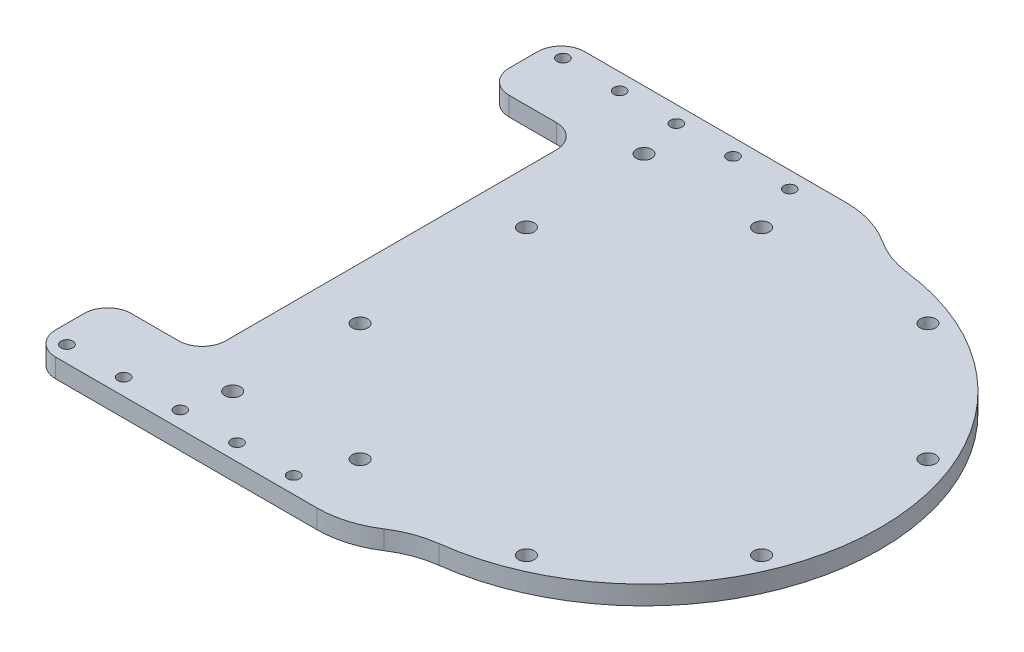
ISO-10303-21;
HEADER;
FILE_DESCRIPTION(('STEP AP214'),'2;1');
FILE_NAME('part.step','',(''),(''),'','','');
FILE_SCHEMA(('AUTOMOTIVE_DESIGN { 1 0 10303 214 1 1 1 1 }'));
ENDSEC;
DATA;
#1=APPLICATION_CONTEXT('core data for automotive mechanical design processes');
#2=APPLICATION_PROTOCOL_DEFINITION('international standard','automotive_design',2000,#1);
#3=PRODUCT_CONTEXT('',#1,'mechanical');
#4=PRODUCT('Part','Part','',(#3));
#5=PRODUCT_RELATED_PRODUCT_CATEGORY('part','',(#4));
#6=PRODUCT_DEFINITION_FORMATION('','',#4);
#7=PRODUCT_DEFINITION_CONTEXT('part definition',#1,'design');
#8=PRODUCT_DEFINITION('design','',#6,#7);
#9=PRODUCT_DEFINITION_SHAPE('','',#8);
#10=(LENGTH_UNIT() NAMED_UNIT(*) SI_UNIT(.MILLI.,.METRE.));
#11=(NAMED_UNIT(*) PLANE_ANGLE_UNIT() SI_UNIT($,.RADIAN.));
#12=(NAMED_UNIT(*) SI_UNIT($,.STERADIAN.) SOLID_ANGLE_UNIT());
#13=UNCERTAINTY_MEASURE_WITH_UNIT(LENGTH_MEASURE(1.E-05),#10,'distance_accuracy_value','');
#14=(GEOMETRIC_REPRESENTATION_CONTEXT(3) GLOBAL_UNCERTAINTY_ASSIGNED_CONTEXT((#13)) GLOBAL_UNIT_ASSIGNED_CONTEXT((#10,
#11,#12)) REPRESENTATION_CONTEXT('',''));
#15=CARTESIAN_POINT('',(0.,0.,0.));
#16=DIRECTION('',(0.,0.,1.));
#17=DIRECTION('',(1.,0.,0.));
#18=AXIS2_PLACEMENT_3D('',#15,#16,#17);
#19=CARTESIAN_POINT('',(83.4007857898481,3.,-81.060672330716));
#20=DIRECTION('',(1.,0.,0.));
#21=DIRECTION('',(0.,0.,-1.));
#22=AXIS2_PLACEMENT_3D('',#19,#20,#21);
#23=PLANE('',#22);
#24=DIRECTION('',(0.,1.,0.));
#25=VECTOR('',#24,1.);
#26=CARTESIAN_POINT('',(83.4007857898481,3.,45.));
#27=LINE('',#26,#25);
#28=CARTESIAN_POINT('',(83.4007857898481,-1.,45.));
#29=VERTEX_POINT('',#28);
#30=CARTESIAN_POINT('',(83.4007857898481,3.,45.));
#31=VERTEX_POINT('',#30);
#32=EDGE_CURVE('E11',#29,#31,#27,.T.);
#33=ORIENTED_EDGE('',*,*,#32,.F.);
#34=DIRECTION('',(0.,0.,1.));
#35=VECTOR('',#34,1.);
#36=CARTESIAN_POINT('',(83.4007857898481,-1.,0.));
#37=LINE('',#36,#35);
#38=CARTESIAN_POINT('',(83.4007857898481,-1.,51.));
#39=VERTEX_POINT('',#38);
#40=EDGE_CURVE('E152',#39,#29,#37,.F.);
#41=ORIENTED_EDGE('',*,*,#40,.F.);
#42=DIRECTION('',(0.,1.,0.));
#43=VECTOR('',#42,1.);
#44=CARTESIAN_POINT('',(83.4007857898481,3.,51.));
#45=LINE('',#44,#43);
#46=CARTESIAN_POINT('',(83.4007857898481,3.,51.));
#47=VERTEX_POINT('',#46);
#48=EDGE_CURVE('E64',#39,#47,#45,.T.);
#49=ORIENTED_EDGE('',*,*,#48,.T.);
#50=DIRECTION('',(0.,0.,-1.));
#51=VECTOR('',#50,1.);
#52=CARTESIAN_POINT('',(83.4007857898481,3.,-81.060672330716));
#53=LINE('',#52,#51);
#54=EDGE_CURVE('E291',#47,#31,#53,.T.);
#55=ORIENTED_EDGE('',*,*,#54,.T.);
#56=EDGE_LOOP('',(#33,#41,#49,#55));
#57=FACE_BOUND('',#56,.T.);
#58=ADVANCED_FACE('F53',(#57),#23,.F.);
#59=CARTESIAN_POINT('',(88.4007857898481,3.,51.));
#60=DIRECTION('',(0.,1.,0.));
#61=DIRECTION('',(0.,0.,1.));
#62=AXIS2_PLACEMENT_3D('',#59,#60,#61);
#63=CYLINDRICAL_SURFACE('',#62,5.);
#64=ORIENTED_EDGE('',*,*,#48,.F.);
#65=CARTESIAN_POINT('',(88.4007857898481,-1.,51.));
#66=DIRECTION('',(0.,1.,0.));
#67=DIRECTION('',(0.,0.,1.));
#68=AXIS2_PLACEMENT_3D('',#65,#66,#67);
#69=CIRCLE('',#68,5.);
#70=CARTESIAN_POINT('',(88.4007857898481,-1.,56.));
#71=VERTEX_POINT('',#70);
#72=EDGE_CURVE('E222',#39,#71,#69,.T.);
#73=ORIENTED_EDGE('',*,*,#72,.T.);
#74=DIRECTION('',(0.,1.,0.));
#75=VECTOR('',#74,1.);
#76=CARTESIAN_POINT('',(88.4007857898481,3.,56.));
#77=LINE('',#76,#75);
#78=CARTESIAN_POINT('',(88.4007857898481,3.,56.));
#79=VERTEX_POINT('',#78);
#80=EDGE_CURVE('E281',#71,#79,#77,.T.);
#81=ORIENTED_EDGE('',*,*,#80,.T.);
#82=CARTESIAN_POINT('',(88.4007857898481,3.,51.));
#83=DIRECTION('',(0.,1.,0.));
#84=DIRECTION('',(0.,0.,1.));
#85=AXIS2_PLACEMENT_3D('',#82,#83,#84);
#86=CIRCLE('',#85,5.);
#87=EDGE_CURVE('E300',#47,#79,#86,.T.);
#88=ORIENTED_EDGE('',*,*,#87,.F.);
#89=EDGE_LOOP('',(#64,#73,#81,#88));
#90=FACE_BOUND('',#89,.T.);
#91=ADVANCED_FACE('F305',(#90),#63,.T.);
#92=CARTESIAN_POINT('',(-100.,3.,56.));
#93=DIRECTION('',(0.,0.,1.));
#94=DIRECTION('',(1.,0.,0.));
#95=AXIS2_PLACEMENT_3D('',#92,#93,#94);
#96=PLANE('',#95);
#97=ORIENTED_EDGE('',*,*,#80,.F.);
#98=DIRECTION('',(1.,0.,0.));
#99=VECTOR('',#98,1.);
#100=CARTESIAN_POINT('',(0.,-1.,56.));
#101=LINE('',#100,#99);
#102=CARTESIAN_POINT('',(143.705644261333,-1.,56.));
#103=VERTEX_POINT('',#102);
#104=EDGE_CURVE('E218',#71,#103,#101,.T.);
#105=ORIENTED_EDGE('',*,*,#104,.T.);
#106=DIRECTION('',(0.,1.,0.));
#107=VECTOR('',#106,1.);
#108=CARTESIAN_POINT('',(143.705644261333,3.,56.));
#109=LINE('',#108,#107);
#110=CARTESIAN_POINT('',(143.705644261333,3.,56.));
#111=VERTEX_POINT('',#110);
#112=EDGE_CURVE('E277',#103,#111,#109,.T.);
#113=ORIENTED_EDGE('',*,*,#112,.T.);
#114=DIRECTION('',(1.,0.,0.));
#115=VECTOR('',#114,1.);
#116=CARTESIAN_POINT('',(-100.,3.,56.));
#117=LINE('',#116,#115);
#118=EDGE_CURVE('E307',#79,#111,#117,.T.);
#119=ORIENTED_EDGE('',*,*,#118,.F.);
#120=EDGE_LOOP('',(#97,#105,#113,#119));
#121=FACE_BOUND('',#120,.T.);
#122=ADVANCED_FACE('F459',(#121),#96,.T.);
#123=CARTESIAN_POINT('',(143.705644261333,3.,36.));
#124=DIRECTION('',(0.,1.,0.));
#125=DIRECTION('',(0.,0.,1.));
#126=AXIS2_PLACEMENT_3D('',#123,#124,#125);
#127=CYLINDRICAL_SURFACE('',#126,20.);
#128=ORIENTED_EDGE('',*,*,#112,.F.);
#129=CARTESIAN_POINT('',(143.705644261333,-1.,36.));
#130=DIRECTION('',(0.,1.,0.));
#131=DIRECTION('',(0.,0.,1.));
#132=AXIS2_PLACEMENT_3D('',#129,#130,#131);
#133=CIRCLE('',#132,20.);
#134=CARTESIAN_POINT('',(154.665979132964,-1.,52.7293472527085));
#135=VERTEX_POINT('',#134);
#136=EDGE_CURVE('E214',#103,#135,#133,.T.);
#137=ORIENTED_EDGE('',*,*,#136,.T.);
#138=DIRECTION('',(0.,1.,0.));
#139=VECTOR('',#138,1.);
#140=CARTESIAN_POINT('',(154.665979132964,3.,52.7293472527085));
#141=LINE('',#140,#139);
#142=CARTESIAN_POINT('',(154.665979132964,3.,52.7293472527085));
#143=VERTEX_POINT('',#142);
#144=EDGE_CURVE('E273',#135,#143,#141,.T.);
#145=ORIENTED_EDGE('',*,*,#144,.T.);
#146=CARTESIAN_POINT('',(143.705644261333,3.,36.));
#147=DIRECTION('',(0.,1.,0.));
#148=DIRECTION('',(0.,0.,1.));
#149=AXIS2_PLACEMENT_3D('',#146,#147,#148);
#150=CIRCLE('',#149,20.);
#151=EDGE_CURVE('E311',#111,#143,#150,.T.);
#152=ORIENTED_EDGE('',*,*,#151,.F.);
#153=EDGE_LOOP('',(#128,#137,#145,#152));
#154=FACE_BOUND('',#153,.T.);
#155=ADVANCED_FACE('F938',(#154),#127,.T.);
#156=CARTESIAN_POINT('',(165.626314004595,3.,69.458694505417));
#157=DIRECTION('',(0.,1.,0.));
#158=DIRECTION('',(0.,0.,1.));
#159=AXIS2_PLACEMENT_3D('',#156,#157,#158);
#160=CYLINDRICAL_SURFACE('',#159,20.);
#161=ORIENTED_EDGE('',*,*,#144,.F.);
#162=CARTESIAN_POINT('',(165.626314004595,-1.,69.458694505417));
#163=DIRECTION('',(0.,1.,0.));
#164=DIRECTION('',(0.,0.,1.));
#165=AXIS2_PLACEMENT_3D('',#162,#163,#164);
#166=CIRCLE('',#165,20.);
#167=CARTESIAN_POINT('',(163.14388994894,-1.,49.613353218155));
#168=VERTEX_POINT('',#167);
#169=EDGE_CURVE('E210',#135,#168,#166,.F.);
#170=ORIENTED_EDGE('',*,*,#169,.T.);
#171=DIRECTION('',(0.,1.,0.));
#172=VECTOR('',#171,1.);
#173=CARTESIAN_POINT('',(163.14388994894,3.,49.613353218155));
#174=LINE('',#173,#172);
#175=CARTESIAN_POINT('',(163.14388994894,3.,49.613353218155));
#176=VERTEX_POINT('',#175);
#177=EDGE_CURVE('E269',#168,#176,#174,.T.);
#178=ORIENTED_EDGE('',*,*,#177,.T.);
#179=CARTESIAN_POINT('',(165.626314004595,3.,69.458694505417));
#180=DIRECTION('',(0.,1.,0.));
#181=DIRECTION('',(0.,0.,1.));
#182=AXIS2_PLACEMENT_3D('',#179,#180,#181);
#183=CIRCLE('',#182,20.);
#184=EDGE_CURVE('E318',#143,#176,#183,.F.);
#185=ORIENTED_EDGE('',*,*,#184,.F.);
#186=EDGE_LOOP('',(#161,#170,#178,#185));
#187=FACE_BOUND('',#186,.T.);
#188=ADVANCED_FACE('F928',(#187),#160,.F.);
#189=CARTESIAN_POINT('',(156.937829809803,3.,0.));
#190=DIRECTION('',(0.,1.,0.));
#191=DIRECTION('',(0.,0.,1.));
#192=AXIS2_PLACEMENT_3D('',#189,#190,#191);
#193=CYLINDRICAL_SURFACE('',#192,50.);
#194=ORIENTED_EDGE('',*,*,#177,.F.);
#195=CARTESIAN_POINT('',(156.937829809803,-1.,0.));
#196=DIRECTION('',(0.,1.,0.));
#197=DIRECTION('',(0.,0.,1.));
#198=AXIS2_PLACEMENT_3D('',#195,#196,#197);
#199=CIRCLE('',#198,50.);
#200=CARTESIAN_POINT('',(163.14388994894,-1.,-49.613353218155));
#201=VERTEX_POINT('',#200);
#202=EDGE_CURVE('E206',#168,#201,#199,.T.);
#203=ORIENTED_EDGE('',*,*,#202,.T.);
#204=DIRECTION('',(0.,1.,0.));
#205=VECTOR('',#204,1.);
#206=CARTESIAN_POINT('',(163.14388994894,3.,-49.613353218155));
#207=LINE('',#206,#205);
#208=CARTESIAN_POINT('',(163.14388994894,3.,-49.613353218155));
#209=VERTEX_POINT('',#208);
#210=EDGE_CURVE('E265',#201,#209,#207,.T.);
#211=ORIENTED_EDGE('',*,*,#210,.T.);
#212=CARTESIAN_POINT('',(156.937829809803,3.,0.));
#213=DIRECTION('',(0.,1.,0.));
#214=DIRECTION('',(0.,0.,1.));
#215=AXIS2_PLACEMENT_3D('',#212,#213,#214);
#216=CIRCLE('',#215,50.);
#217=EDGE_CURVE('E322',#176,#209,#216,.T.);
#218=ORIENTED_EDGE('',*,*,#217,.F.);
#219=EDGE_LOOP('',(#194,#203,#211,#218));
#220=FACE_BOUND('',#219,.T.);
#221=ADVANCED_FACE('F919',(#220),#193,.T.);
#222=CARTESIAN_POINT('',(165.626314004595,3.,-69.458694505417));
#223=DIRECTION('',(0.,1.,0.));
#224=DIRECTION('',(0.,0.,1.));
#225=AXIS2_PLACEMENT_3D('',#222,#223,#224);
#226=CYLINDRICAL_SURFACE('',#225,20.);
#227=ORIENTED_EDGE('',*,*,#210,.F.);
#228=CARTESIAN_POINT('',(165.626314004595,-1.,-69.458694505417));
#229=DIRECTION('',(0.,1.,0.));
#230=DIRECTION('',(0.,0.,1.));
#231=AXIS2_PLACEMENT_3D('',#228,#229,#230);
#232=CIRCLE('',#231,20.);
#233=CARTESIAN_POINT('',(154.665979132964,-1.,-52.7293472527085));
#234=VERTEX_POINT('',#233);
#235=EDGE_CURVE('E202',#201,#234,#232,.F.);
#236=ORIENTED_EDGE('',*,*,#235,.T.);
#237=DIRECTION('',(0.,1.,0.));
#238=VECTOR('',#237,1.);
#239=CARTESIAN_POINT('',(154.665979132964,3.,-52.7293472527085));
#240=LINE('',#239,#238);
#241=CARTESIAN_POINT('',(154.665979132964,3.,-52.7293472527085));
#242=VERTEX_POINT('',#241);
#243=EDGE_CURVE('E261',#234,#242,#240,.T.);
#244=ORIENTED_EDGE('',*,*,#243,.T.);
#245=CARTESIAN_POINT('',(165.626314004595,3.,-69.458694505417));
#246=DIRECTION('',(0.,1.,0.));
#247=DIRECTION('',(0.,0.,1.));
#248=AXIS2_PLACEMENT_3D('',#245,#246,#247);
#249=CIRCLE('',#248,20.);
#250=EDGE_CURVE('E326',#209,#242,#249,.F.);
#251=ORIENTED_EDGE('',*,*,#250,.F.);
#252=EDGE_LOOP('',(#227,#236,#244,#251));
#253=FACE_BOUND('',#252,.T.);
#254=ADVANCED_FACE('F910',(#253),#226,.F.);
#255=CARTESIAN_POINT('',(143.705644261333,3.,-36.));
#256=DIRECTION('',(0.,1.,0.));
#257=DIRECTION('',(0.,0.,1.));
#258=AXIS2_PLACEMENT_3D('',#255,#256,#257);
#259=CYLINDRICAL_SURFACE('',#258,20.);
#260=ORIENTED_EDGE('',*,*,#243,.F.);
#261=CARTESIAN_POINT('',(143.705644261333,-1.,-36.));
#262=DIRECTION('',(0.,1.,0.));
#263=DIRECTION('',(0.,0.,1.));
#264=AXIS2_PLACEMENT_3D('',#261,#262,#263);
#265=CIRCLE('',#264,20.);
#266=CARTESIAN_POINT('',(143.705644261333,-1.,-56.));
#267=VERTEX_POINT('',#266);
#268=EDGE_CURVE('E198',#234,#267,#265,.T.);
#269=ORIENTED_EDGE('',*,*,#268,.T.);
#270=DIRECTION('',(0.,1.,0.));
#271=VECTOR('',#270,1.);
#272=CARTESIAN_POINT('',(143.705644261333,3.,-56.));
#273=LINE('',#272,#271);
#274=CARTESIAN_POINT('',(143.705644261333,3.,-56.));
#275=VERTEX_POINT('',#274);
#276=EDGE_CURVE('E257',#267,#275,#273,.T.);
#277=ORIENTED_EDGE('',*,*,#276,.T.);
#278=CARTESIAN_POINT('',(143.705644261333,3.,-36.));
#279=DIRECTION('',(0.,1.,0.));
#280=DIRECTION('',(0.,0.,1.));
#281=AXIS2_PLACEMENT_3D('',#278,#279,#280);
#282=CIRCLE('',#281,20.);
#283=EDGE_CURVE('E330',#242,#275,#282,.T.);
#284=ORIENTED_EDGE('',*,*,#283,.F.);
#285=EDGE_LOOP('',(#260,#269,#277,#284));
#286=FACE_BOUND('',#285,.T.);
#287=ADVANCED_FACE('F491',(#286),#259,.T.);
#288=CARTESIAN_POINT('',(-100.,3.,-56.));
#289=DIRECTION('',(0.,0.,-1.));
#290=DIRECTION('',(-1.,0.,0.));
#291=AXIS2_PLACEMENT_3D('',#288,#289,#290);
#292=PLANE('',#291);
#293=ORIENTED_EDGE('',*,*,#276,.F.);
#294=DIRECTION('',(1.,0.,0.));
#295=VECTOR('',#294,1.);
#296=CARTESIAN_POINT('',(0.,-1.,-56.));
#297=LINE('',#296,#295);
#298=CARTESIAN_POINT('',(88.4007857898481,-1.,-56.));
#299=VERTEX_POINT('',#298);
#300=EDGE_CURVE('E194',#267,#299,#297,.F.);
#301=ORIENTED_EDGE('',*,*,#300,.T.);
#302=DIRECTION('',(0.,1.,0.));
#303=VECTOR('',#302,1.);
#304=CARTESIAN_POINT('',(88.4007857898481,3.,-56.));
#305=LINE('',#304,#303);
#306=CARTESIAN_POINT('',(88.4007857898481,3.,-56.));
#307=VERTEX_POINT('',#306);
#308=EDGE_CURVE('E253',#299,#307,#305,.T.);
#309=ORIENTED_EDGE('',*,*,#308,.T.);
#310=DIRECTION('',(-1.,0.,0.));
#311=VECTOR('',#310,1.);
#312=CARTESIAN_POINT('',(-100.,3.,-56.));
#313=LINE('',#312,#311);
#314=EDGE_CURVE('E334',#275,#307,#313,.T.);
#315=ORIENTED_EDGE('',*,*,#314,.F.);
#316=EDGE_LOOP('',(#293,#301,#309,#315));
#317=FACE_BOUND('',#316,.T.);
#318=ADVANCED_FACE('F471',(#317),#292,.T.);
#319=CARTESIAN_POINT('',(88.4007857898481,3.,-51.));
#320=DIRECTION('',(0.,1.,0.));
#321=DIRECTION('',(0.,0.,1.));
#322=AXIS2_PLACEMENT_3D('',#319,#320,#321);
#323=CYLINDRICAL_SURFACE('',#322,5.);
#324=ORIENTED_EDGE('',*,*,#308,.F.);
#325=CARTESIAN_POINT('',(88.4007857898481,-1.,-51.));
#326=DIRECTION('',(0.,1.,0.));
#327=DIRECTION('',(0.,0.,1.));
#328=AXIS2_PLACEMENT_3D('',#325,#326,#327);
#329=CIRCLE('',#328,5.);
#330=CARTESIAN_POINT('',(83.4007857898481,-1.,-51.));
#331=VERTEX_POINT('',#330);
#332=EDGE_CURVE('E190',#299,#331,#329,.T.);
#333=ORIENTED_EDGE('',*,*,#332,.T.);
#334=DIRECTION('',(0.,1.,0.));
#335=VECTOR('',#334,1.);
#336=CARTESIAN_POINT('',(83.4007857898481,3.,-51.));
#337=LINE('',#336,#335);
#338=CARTESIAN_POINT('',(83.4007857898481,3.,-51.));
#339=VERTEX_POINT('',#338);
#340=EDGE_CURVE('E249',#331,#339,#337,.T.);
#341=ORIENTED_EDGE('',*,*,#340,.T.);
#342=CARTESIAN_POINT('',(88.4007857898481,3.,-51.));
#343=DIRECTION('',(0.,1.,0.));
#344=DIRECTION('',(0.,0.,1.));
#345=AXIS2_PLACEMENT_3D('',#342,#343,#344);
#346=CIRCLE('',#345,5.);
#347=EDGE_CURVE('E338',#307,#339,#346,.T.);
#348=ORIENTED_EDGE('',*,*,#347,.F.);
#349=EDGE_LOOP('',(#324,#333,#341,#348));
#350=FACE_BOUND('',#349,.T.);
#351=ADVANCED_FACE('F464',(#350),#323,.T.);
#352=ORIENTED_EDGE('',*,*,#340,.F.);
#353=DIRECTION('',(0.,0.,1.));
#354=VECTOR('',#353,1.);
#355=CARTESIAN_POINT('',(83.4007857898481,-1.,0.));
#356=LINE('',#355,#354);
#357=CARTESIAN_POINT('',(83.4007857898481,-1.,-45.));
#358=VERTEX_POINT('',#357);
#359=EDGE_CURVE('E186',#358,#331,#356,.F.);
#360=ORIENTED_EDGE('',*,*,#359,.F.);
#361=DIRECTION('',(0.,1.,0.));
#362=VECTOR('',#361,1.);
#363=CARTESIAN_POINT('',(83.4007857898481,3.,-45.));
#364=LINE('',#363,#362);
#365=CARTESIAN_POINT('',(83.4007857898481,3.,-45.));
#366=VERTEX_POINT('',#365);
#367=EDGE_CURVE('E245',#358,#366,#364,.T.);
#368=ORIENTED_EDGE('',*,*,#367,.T.);
#369=EDGE_CURVE('E304',#366,#339,#53,.T.);
#370=ORIENTED_EDGE('',*,*,#369,.T.);
#371=EDGE_LOOP('',(#352,#360,#368,#370));
#372=FACE_BOUND('',#371,.T.);
#373=ADVANCED_FACE('F456',(#372),#23,.F.);
#374=CARTESIAN_POINT('',(88.4007857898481,3.,-45.));
#375=DIRECTION('',(0.,1.,0.));
#376=DIRECTION('',(0.,0.,1.));
#377=AXIS2_PLACEMENT_3D('',#374,#375,#376);
#378=CYLINDRICAL_SURFACE('',#377,5.);
#379=ORIENTED_EDGE('',*,*,#367,.F.);
#380=CARTESIAN_POINT('',(88.4007857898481,-1.,-45.));
#381=DIRECTION('',(0.,1.,0.));
#382=DIRECTION('',(0.,0.,1.));
#383=AXIS2_PLACEMENT_3D('',#380,#381,#382);
#384=CIRCLE('',#383,5.);
#385=CARTESIAN_POINT('',(88.4007857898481,-1.,-40.));
#386=VERTEX_POINT('',#385);
#387=EDGE_CURVE('E182',#358,#386,#384,.T.);
#388=ORIENTED_EDGE('',*,*,#387,.T.);
#389=DIRECTION('',(0.,1.,0.));
#390=VECTOR('',#389,1.);
#391=CARTESIAN_POINT('',(88.4007857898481,3.,-40.));
#392=LINE('',#391,#390);
#393=CARTESIAN_POINT('',(88.4007857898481,3.,-40.));
#394=VERTEX_POINT('',#393);
#395=EDGE_CURVE('E241',#386,#394,#392,.T.);
#396=ORIENTED_EDGE('',*,*,#395,.T.);
#397=CARTESIAN_POINT('',(88.4007857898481,3.,-45.));
#398=DIRECTION('',(0.,1.,0.));
#399=DIRECTION('',(0.,0.,1.));
#400=AXIS2_PLACEMENT_3D('',#397,#398,#399);
#401=CIRCLE('',#400,5.);
#402=EDGE_CURVE('E342',#366,#394,#401,.T.);
#403=ORIENTED_EDGE('',*,*,#402,.F.);
#404=EDGE_LOOP('',(#379,#388,#396,#403));
#405=FACE_BOUND('',#404,.T.);
#406=ADVANCED_FACE('F463',(#405),#378,.T.);
#407=CARTESIAN_POINT('',(0.,3.,-40.));
#408=DIRECTION('',(0.,0.,-1.));
#409=DIRECTION('',(-1.,0.,0.));
#410=AXIS2_PLACEMENT_3D('',#407,#408,#409);
#411=PLANE('',#410);
#412=ORIENTED_EDGE('',*,*,#395,.F.);
#413=DIRECTION('',(1.,0.,0.));
#414=VECTOR('',#413,1.);
#415=CARTESIAN_POINT('',(0.,-1.,-40.));
#416=LINE('',#415,#414);
#417=CARTESIAN_POINT('',(98.4007857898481,-1.,-40.));
#418=VERTEX_POINT('',#417);
#419=EDGE_CURVE('E178',#418,#386,#416,.F.);
#420=ORIENTED_EDGE('',*,*,#419,.F.);
#421=DIRECTION('',(0.,1.,0.));
#422=VECTOR('',#421,1.);
#423=CARTESIAN_POINT('',(98.4007857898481,3.,-40.));
#424=LINE('',#423,#422);
#425=CARTESIAN_POINT('',(98.4007857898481,3.,-40.));
#426=VERTEX_POINT('',#425);
#427=EDGE_CURVE('E237',#418,#426,#424,.T.);
#428=ORIENTED_EDGE('',*,*,#427,.T.);
#429=DIRECTION('',(-1.,0.,0.));
#430=VECTOR('',#429,1.);
#431=CARTESIAN_POINT('',(0.,3.,-40.));
#432=LINE('',#431,#430);
#433=EDGE_CURVE('E346',#426,#394,#432,.T.);
#434=ORIENTED_EDGE('',*,*,#433,.T.);
#435=EDGE_LOOP('',(#412,#420,#428,#434));
#436=FACE_BOUND('',#435,.T.);
#437=ADVANCED_FACE('F469',(#436),#411,.F.);
#438=CARTESIAN_POINT('',(98.4007857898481,3.,-35.));
#439=DIRECTION('',(0.,1.,0.));
#440=DIRECTION('',(0.,0.,1.));
#441=AXIS2_PLACEMENT_3D('',#438,#439,#440);
#442=CYLINDRICAL_SURFACE('',#441,5.);
#443=ORIENTED_EDGE('',*,*,#427,.F.);
#444=CARTESIAN_POINT('',(98.4007857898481,-1.,-35.));
#445=DIRECTION('',(0.,1.,0.));
#446=DIRECTION('',(0.,0.,1.));
#447=AXIS2_PLACEMENT_3D('',#444,#445,#446);
#448=CIRCLE('',#447,5.);
#449=CARTESIAN_POINT('',(103.400785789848,-1.,-35.));
#450=VERTEX_POINT('',#449);
#451=EDGE_CURVE('E174',#418,#450,#448,.F.);
#452=ORIENTED_EDGE('',*,*,#451,.T.);
#453=DIRECTION('',(0.,1.,0.));
#454=VECTOR('',#453,1.);
#455=CARTESIAN_POINT('',(103.400785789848,3.,-35.));
#456=LINE('',#455,#454);
#457=CARTESIAN_POINT('',(103.400785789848,3.,-35.));
#458=VERTEX_POINT('',#457);
#459=EDGE_CURVE('E233',#450,#458,#456,.T.);
#460=ORIENTED_EDGE('',*,*,#459,.T.);
#461=CARTESIAN_POINT('',(98.4007857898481,3.,-35.));
#462=DIRECTION('',(0.,1.,0.));
#463=DIRECTION('',(0.,0.,1.));
#464=AXIS2_PLACEMENT_3D('',#461,#462,#463);
#465=CIRCLE('',#464,5.);
#466=EDGE_CURVE('E350',#426,#458,#465,.F.);
#467=ORIENTED_EDGE('',*,*,#466,.F.);
#468=EDGE_LOOP('',(#443,#452,#460,#467));
#469=FACE_BOUND('',#468,.T.);
#470=ADVANCED_FACE('F508',(#469),#442,.F.);
#471=CARTESIAN_POINT('',(103.400785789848,3.,0.));
#472=DIRECTION('',(1.,0.,0.));
#473=DIRECTION('',(0.,0.,-1.));
#474=AXIS2_PLACEMENT_3D('',#471,#472,#473);
#475=PLANE('',#474);
#476=ORIENTED_EDGE('',*,*,#459,.F.);
#477=DIRECTION('',(0.,0.,1.));
#478=VECTOR('',#477,1.);
#479=CARTESIAN_POINT('',(103.400785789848,-1.,0.));
#480=LINE('',#479,#478);
#481=CARTESIAN_POINT('',(103.400785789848,-1.,35.));
#482=VERTEX_POINT('',#481);
#483=EDGE_CURVE('E170',#482,#450,#480,.F.);
#484=ORIENTED_EDGE('',*,*,#483,.F.);
#485=DIRECTION('',(0.,1.,0.));
#486=VECTOR('',#485,1.);
#487=CARTESIAN_POINT('',(103.400785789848,3.,35.));
#488=LINE('',#487,#486);
#489=CARTESIAN_POINT('',(103.400785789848,3.,35.));
#490=VERTEX_POINT('',#489);
#491=EDGE_CURVE('E230',#482,#490,#488,.T.);
#492=ORIENTED_EDGE('',*,*,#491,.T.);
#493=DIRECTION('',(0.,0.,-1.));
#494=VECTOR('',#493,1.);
#495=CARTESIAN_POINT('',(103.400785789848,3.,0.));
#496=LINE('',#495,#494);
#497=EDGE_CURVE('E354',#490,#458,#496,.T.);
#498=ORIENTED_EDGE('',*,*,#497,.T.);
#499=EDGE_LOOP('',(#476,#484,#492,#498));
#500=FACE_BOUND('',#499,.T.);
#501=ADVANCED_FACE('F514',(#500),#475,.F.);
#502=CARTESIAN_POINT('',(98.4007857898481,3.,35.));
#503=DIRECTION('',(0.,1.,0.));
#504=DIRECTION('',(0.,0.,1.));
#505=AXIS2_PLACEMENT_3D('',#502,#503,#504);
#506=CYLINDRICAL_SURFACE('',#505,5.);
#507=ORIENTED_EDGE('',*,*,#491,.F.);
#508=CARTESIAN_POINT('',(98.4007857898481,-1.,35.));
#509=DIRECTION('',(0.,1.,0.));
#510=DIRECTION('',(0.,0.,1.));
#511=AXIS2_PLACEMENT_3D('',#508,#509,#510);
#512=CIRCLE('',#511,5.);
#513=CARTESIAN_POINT('',(98.4007857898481,-1.,40.));
#514=VERTEX_POINT('',#513);
#515=EDGE_CURVE('E166',#482,#514,#512,.F.);
#516=ORIENTED_EDGE('',*,*,#515,.T.);
#517=DIRECTION('',(0.,1.,0.));
#518=VECTOR('',#517,1.);
#519=CARTESIAN_POINT('',(98.4007857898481,3.,40.));
#520=LINE('',#519,#518);
#521=CARTESIAN_POINT('',(98.4007857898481,3.,40.));
#522=VERTEX_POINT('',#521);
#523=EDGE_CURVE('E72',#514,#522,#520,.T.);
#524=ORIENTED_EDGE('',*,*,#523,.T.);
#525=CARTESIAN_POINT('',(98.4007857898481,3.,35.));
#526=DIRECTION('',(0.,1.,0.));
#527=DIRECTION('',(0.,0.,1.));
#528=AXIS2_PLACEMENT_3D('',#525,#526,#527);
#529=CIRCLE('',#528,5.);
#530=EDGE_CURVE('E145',#490,#522,#529,.F.);
#531=ORIENTED_EDGE('',*,*,#530,.F.);
#532=EDGE_LOOP('',(#507,#516,#524,#531));
#533=FACE_BOUND('',#532,.T.);
#534=ADVANCED_FACE('F515',(#533),#506,.F.);
#535=CARTESIAN_POINT('',(0.,3.,40.));
#536=DIRECTION('',(0.,0.,-1.));
#537=DIRECTION('',(-1.,0.,0.));
#538=AXIS2_PLACEMENT_3D('',#535,#536,#537);
#539=PLANE('',#538);
#540=ORIENTED_EDGE('',*,*,#523,.F.);
#541=DIRECTION('',(1.,0.,0.));
#542=VECTOR('',#541,1.);
#543=CARTESIAN_POINT('',(0.,-1.,40.));
#544=LINE('',#543,#542);
#545=CARTESIAN_POINT('',(88.4007857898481,-1.,40.));
#546=VERTEX_POINT('',#545);
#547=EDGE_CURVE('E150',#514,#546,#544,.F.);
#548=ORIENTED_EDGE('',*,*,#547,.T.);
#549=DIRECTION('',(0.,1.,0.));
#550=VECTOR('',#549,1.);
#551=CARTESIAN_POINT('',(88.4007857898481,3.,40.));
#552=LINE('',#551,#550);
#553=CARTESIAN_POINT('',(88.4007857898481,3.,40.));
#554=VERTEX_POINT('',#553);
#555=EDGE_CURVE('E57',#546,#554,#552,.T.);
#556=ORIENTED_EDGE('',*,*,#555,.T.);
#557=DIRECTION('',(-1.,0.,0.));
#558=VECTOR('',#557,1.);
#559=CARTESIAN_POINT('',(0.,3.,40.));
#560=LINE('',#559,#558);
#561=EDGE_CURVE('E516',#522,#554,#560,.T.);
#562=ORIENTED_EDGE('',*,*,#561,.F.);
#563=EDGE_LOOP('',(#540,#548,#556,#562));
#564=FACE_BOUND('',#563,.T.);
#565=ADVANCED_FACE('F155',(#564),#539,.T.);
#566=CARTESIAN_POINT('',(99.2778298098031,3.,52.4999999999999));
#567=DIRECTION('',(0.,1.,0.));
#568=DIRECTION('',(0.,0.,1.));
#569=AXIS2_PLACEMENT_3D('',#566,#567,#568);
#570=CYLINDRICAL_SURFACE('',#569,1.25);
#571=CARTESIAN_POINT('',(99.2778298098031,3.,52.4999999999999));
#572=DIRECTION('',(0.,-1.,0.));
#573=DIRECTION('',(0.,0.,-1.));
#574=AXIS2_PLACEMENT_3D('',#571,#572,#573);
#575=CIRCLE('',#574,1.25);
#576=CARTESIAN_POINT('',(99.2778298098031,3.,51.2499999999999));
#577=VERTEX_POINT('',#576);
#578=EDGE_CURVE('E169',#577,#577,#575,.T.);
#579=ORIENTED_EDGE('',*,*,#578,.F.);
#580=EDGE_LOOP('',(#579));
#581=FACE_BOUND('',#580,.T.);
#582=CARTESIAN_POINT('',(99.2778298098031,-1.,52.4999999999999));
#583=DIRECTION('',(0.,-1.,0.));
#584=DIRECTION('',(0.,0.,-1.));
#585=AXIS2_PLACEMENT_3D('',#582,#583,#584);
#586=CIRCLE('',#585,1.25);
#587=CARTESIAN_POINT('',(99.2778298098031,-1.,51.2499999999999));
#588=VERTEX_POINT('',#587);
#589=EDGE_CURVE('E361',#588,#588,#586,.T.);
#590=ORIENTED_EDGE('',*,*,#589,.T.);
#591=EDGE_LOOP('',(#590));
#592=FACE_BOUND('',#591,.T.);
#593=ADVANCED_FACE('F605',(#581,#592),#570,.F.);
#594=CARTESIAN_POINT('',(135.277829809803,3.,52.5));
#595=DIRECTION('',(0.,1.,0.));
#596=DIRECTION('',(0.,0.,1.));
#597=AXIS2_PLACEMENT_3D('',#594,#595,#596);
#598=CYLINDRICAL_SURFACE('',#597,1.25000000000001);
#599=CARTESIAN_POINT('',(135.277829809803,3.,52.5));
#600=DIRECTION('',(0.,1.,0.));
#601=DIRECTION('',(0.,0.,1.));
#602=AXIS2_PLACEMENT_3D('',#599,#600,#601);
#603=CIRCLE('',#602,1.25000000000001);
#604=CARTESIAN_POINT('',(135.277829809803,3.,53.75));
#605=VERTEX_POINT('',#604);
#606=EDGE_CURVE('E594',#605,#605,#603,.F.);
#607=ORIENTED_EDGE('',*,*,#606,.F.);
#608=EDGE_LOOP('',(#607));
#609=FACE_BOUND('',#608,.T.);
#610=CARTESIAN_POINT('',(135.277829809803,-1.,52.5));
#611=DIRECTION('',(0.,1.,0.));
#612=DIRECTION('',(0.,0.,1.));
#613=AXIS2_PLACEMENT_3D('',#610,#611,#612);
#614=CIRCLE('',#613,1.25000000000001);
#615=CARTESIAN_POINT('',(135.277829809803,-1.,53.75));
#616=VERTEX_POINT('',#615);
#617=EDGE_CURVE('E365',#616,#616,#614,.F.);
#618=ORIENTED_EDGE('',*,*,#617,.T.);
#619=EDGE_LOOP('',(#618));
#620=FACE_BOUND('',#619,.T.);
#621=ADVANCED_FACE('F608',(#609,#620),#598,.F.);
#622=CARTESIAN_POINT('',(123.277829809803,3.,52.4999999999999));
#623=DIRECTION('',(0.,1.,0.));
#624=DIRECTION('',(0.,0.,1.));
#625=AXIS2_PLACEMENT_3D('',#622,#623,#624);
#626=CYLINDRICAL_SURFACE('',#625,1.25);
#627=CARTESIAN_POINT('',(123.277829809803,3.,52.4999999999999));
#628=DIRECTION('',(0.,1.,0.));
#629=DIRECTION('',(0.,0.,1.));
#630=AXIS2_PLACEMENT_3D('',#627,#628,#629);
#631=CIRCLE('',#630,1.25);
#632=CARTESIAN_POINT('',(123.277829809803,3.,53.7499999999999));
#633=VERTEX_POINT('',#632);
#634=EDGE_CURVE('E590',#633,#633,#631,.F.);
#635=ORIENTED_EDGE('',*,*,#634,.F.);
#636=EDGE_LOOP('',(#635));
#637=FACE_BOUND('',#636,.T.);
#638=CARTESIAN_POINT('',(123.277829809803,-1.,52.4999999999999));
#639=DIRECTION('',(0.,1.,0.));
#640=DIRECTION('',(0.,0.,1.));
#641=AXIS2_PLACEMENT_3D('',#638,#639,#640);
#642=CIRCLE('',#641,1.25);
#643=CARTESIAN_POINT('',(123.277829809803,-1.,53.7499999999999));
#644=VERTEX_POINT('',#643);
#645=EDGE_CURVE('E369',#644,#644,#642,.F.);
#646=ORIENTED_EDGE('',*,*,#645,.T.);
#647=EDGE_LOOP('',(#646));
#648=FACE_BOUND('',#647,.T.);
#649=ADVANCED_FACE('F706',(#637,#648),#626,.F.);
#650=CARTESIAN_POINT('',(87.2778298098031,3.,52.5));
#651=DIRECTION('',(0.,1.,0.));
#652=DIRECTION('',(0.,0.,1.));
#653=AXIS2_PLACEMENT_3D('',#650,#651,#652);
#654=CYLINDRICAL_SURFACE('',#653,1.25);
#655=CARTESIAN_POINT('',(87.2778298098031,3.,52.5));
#656=DIRECTION('',(0.,-1.,0.));
#657=DIRECTION('',(0.,0.,-1.));
#658=AXIS2_PLACEMENT_3D('',#655,#656,#657);
#659=CIRCLE('',#658,1.25);
#660=CARTESIAN_POINT('',(87.2778298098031,3.,51.25));
#661=VERTEX_POINT('',#660);
#662=EDGE_CURVE('E586',#661,#661,#659,.T.);
#663=ORIENTED_EDGE('',*,*,#662,.F.);
#664=EDGE_LOOP('',(#663));
#665=FACE_BOUND('',#664,.T.);
#666=CARTESIAN_POINT('',(87.2778298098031,-1.,52.5));
#667=DIRECTION('',(0.,-1.,0.));
#668=DIRECTION('',(0.,0.,-1.));
#669=AXIS2_PLACEMENT_3D('',#666,#667,#668);
#670=CIRCLE('',#669,1.25);
#671=CARTESIAN_POINT('',(87.2778298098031,-1.,51.25));
#672=VERTEX_POINT('',#671);
#673=EDGE_CURVE('E373',#672,#672,#670,.T.);
#674=ORIENTED_EDGE('',*,*,#673,.T.);
#675=EDGE_LOOP('',(#674));
#676=FACE_BOUND('',#675,.T.);
#677=ADVANCED_FACE('F702',(#665,#676),#654,.F.);
#678=CARTESIAN_POINT('',(111.277829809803,3.,52.4999999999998));
#679=DIRECTION('',(0.,1.,0.));
#680=DIRECTION('',(0.,0.,1.));
#681=AXIS2_PLACEMENT_3D('',#678,#679,#680);
#682=CYLINDRICAL_SURFACE('',#681,1.25);
#683=CARTESIAN_POINT('',(111.277829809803,3.,52.4999999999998));
#684=DIRECTION('',(0.,1.,0.));
#685=DIRECTION('',(0.,0.,1.));
#686=AXIS2_PLACEMENT_3D('',#683,#684,#685);
#687=CIRCLE('',#686,1.25);
#688=CARTESIAN_POINT('',(111.277829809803,3.,53.7499999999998));
#689=VERTEX_POINT('',#688);
#690=EDGE_CURVE('E582',#689,#689,#687,.F.);
#691=ORIENTED_EDGE('',*,*,#690,.F.);
#692=EDGE_LOOP('',(#691));
#693=FACE_BOUND('',#692,.T.);
#694=CARTESIAN_POINT('',(111.277829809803,-1.,52.4999999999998));
#695=DIRECTION('',(0.,1.,0.));
#696=DIRECTION('',(0.,0.,1.));
#697=AXIS2_PLACEMENT_3D('',#694,#695,#696);
#698=CIRCLE('',#697,1.25);
#699=CARTESIAN_POINT('',(111.277829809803,-1.,53.7499999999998));
#700=VERTEX_POINT('',#699);
#701=EDGE_CURVE('E377',#700,#700,#698,.F.);
#702=ORIENTED_EDGE('',*,*,#701,.T.);
#703=EDGE_LOOP('',(#702));
#704=FACE_BOUND('',#703,.T.);
#705=ADVANCED_FACE('F698',(#693,#704),#682,.F.);
#706=CARTESIAN_POINT('',(113.400785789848,3.,43.5370440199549));
#707=DIRECTION('',(0.,1.,0.));
#708=DIRECTION('',(0.,0.,1.));
#709=AXIS2_PLACEMENT_3D('',#706,#707,#708);
#710=CYLINDRICAL_SURFACE('',#709,1.65);
#711=CARTESIAN_POINT('',(113.400785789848,3.,43.5370440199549));
#712=DIRECTION('',(0.,1.,0.));
#713=DIRECTION('',(0.,0.,1.));
#714=AXIS2_PLACEMENT_3D('',#711,#712,#713);
#715=CIRCLE('',#714,1.65);
#716=CARTESIAN_POINT('',(113.400785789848,3.,45.1870440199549));
#717=VERTEX_POINT('',#716);
#718=EDGE_CURVE('E578',#717,#717,#715,.F.);
#719=ORIENTED_EDGE('',*,*,#718,.F.);
#720=EDGE_LOOP('',(#719));
#721=FACE_BOUND('',#720,.T.);
#722=CARTESIAN_POINT('',(113.400785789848,-1.,43.5370440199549));
#723=DIRECTION('',(0.,1.,0.));
#724=DIRECTION('',(0.,0.,1.));
#725=AXIS2_PLACEMENT_3D('',#722,#723,#724);
#726=CIRCLE('',#725,1.65);
#727=CARTESIAN_POINT('',(113.400785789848,-1.,45.1870440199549));
#728=VERTEX_POINT('',#727);
#729=EDGE_CURVE('E381',#728,#728,#726,.F.);
#730=ORIENTED_EDGE('',*,*,#729,.T.);
#731=EDGE_LOOP('',(#730));
#732=FACE_BOUND('',#731,.T.);
#733=ADVANCED_FACE('F694',(#721,#732),#710,.F.);
#734=CARTESIAN_POINT('',(139.335954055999,3.,42.4991055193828));
#735=DIRECTION('',(0.,1.,0.));
#736=DIRECTION('',(0.,0.,1.));
#737=AXIS2_PLACEMENT_3D('',#734,#735,#736);
#738=CYLINDRICAL_SURFACE('',#737,1.65000000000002);
#739=CARTESIAN_POINT('',(139.335954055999,3.,42.4991055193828));
#740=DIRECTION('',(0.,1.,0.));
#741=DIRECTION('',(0.,0.,1.));
#742=AXIS2_PLACEMENT_3D('',#739,#740,#741);
#743=CIRCLE('',#742,1.65000000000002);
#744=CARTESIAN_POINT('',(139.335954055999,3.,44.1491055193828));
#745=VERTEX_POINT('',#744);
#746=EDGE_CURVE('E574',#745,#745,#743,.T.);
#747=ORIENTED_EDGE('',*,*,#746,.T.);
#748=EDGE_LOOP('',(#747));
#749=FACE_BOUND('',#748,.T.);
#750=CARTESIAN_POINT('',(139.335954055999,-1.,42.4991055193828));
#751=DIRECTION('',(0.,1.,0.));
#752=DIRECTION('',(0.,0.,1.));
#753=AXIS2_PLACEMENT_3D('',#750,#751,#752);
#754=CIRCLE('',#753,1.65000000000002);
#755=CARTESIAN_POINT('',(139.335954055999,-1.,44.1491055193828));
#756=VERTEX_POINT('',#755);
#757=EDGE_CURVE('E385',#756,#756,#754,.T.);
#758=ORIENTED_EDGE('',*,*,#757,.F.);
#759=EDGE_LOOP('',(#758));
#760=FACE_BOUND('',#759,.T.);
#761=ADVANCED_FACE('F690',(#749,#760),#738,.F.);
#762=CARTESIAN_POINT('',(174.539705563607,3.,-42.4991055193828));
#763=DIRECTION('',(0.,1.,0.));
#764=DIRECTION('',(0.,0.,1.));
#765=AXIS2_PLACEMENT_3D('',#762,#763,#764);
#766=CYLINDRICAL_SURFACE('',#765,1.65000000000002);
#767=CARTESIAN_POINT('',(174.539705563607,3.,-42.4991055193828));
#768=DIRECTION('',(0.,1.,0.));
#769=DIRECTION('',(0.,0.,1.));
#770=AXIS2_PLACEMENT_3D('',#767,#768,#769);
#771=CIRCLE('',#770,1.65000000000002);
#772=CARTESIAN_POINT('',(174.539705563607,3.,-40.8491055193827));
#773=VERTEX_POINT('',#772);
#774=EDGE_CURVE('E570',#773,#773,#771,.T.);
#775=ORIENTED_EDGE('',*,*,#774,.T.);
#776=EDGE_LOOP('',(#775));
#777=FACE_BOUND('',#776,.T.);
#778=CARTESIAN_POINT('',(174.539705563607,-1.,-42.4991055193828));
#779=DIRECTION('',(0.,1.,0.));
#780=DIRECTION('',(0.,0.,1.));
#781=AXIS2_PLACEMENT_3D('',#778,#779,#780);
#782=CIRCLE('',#781,1.65000000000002);
#783=CARTESIAN_POINT('',(174.539705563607,-1.,-40.8491055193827));
#784=VERTEX_POINT('',#783);
#785=EDGE_CURVE('E389',#784,#784,#782,.T.);
#786=ORIENTED_EDGE('',*,*,#785,.F.);
#787=EDGE_LOOP('',(#786));
#788=FACE_BOUND('',#787,.T.);
#789=ADVANCED_FACE('F686',(#777,#788),#766,.F.);
#790=CARTESIAN_POINT('',(139.332829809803,3.,-42.4978114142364));
#791=DIRECTION('',(0.,1.,0.));
#792=DIRECTION('',(0.,0.,1.));
#793=AXIS2_PLACEMENT_3D('',#790,#791,#792);
#794=CYLINDRICAL_SURFACE('',#793,1.65000000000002);
#795=CARTESIAN_POINT('',(139.332829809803,3.,-42.4978114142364));
#796=DIRECTION('',(0.,1.,0.));
#797=DIRECTION('',(0.,0.,1.));
#798=AXIS2_PLACEMENT_3D('',#795,#796,#797);
#799=CIRCLE('',#798,1.65000000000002);
#800=CARTESIAN_POINT('',(139.332829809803,3.,-40.8478114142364));
#801=VERTEX_POINT('',#800);
#802=EDGE_CURVE('E566',#801,#801,#799,.T.);
#803=ORIENTED_EDGE('',*,*,#802,.T.);
#804=EDGE_LOOP('',(#803));
#805=FACE_BOUND('',#804,.T.);
#806=CARTESIAN_POINT('',(139.332829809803,-1.,-42.4978114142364));
#807=DIRECTION('',(0.,1.,0.));
#808=DIRECTION('',(0.,0.,1.));
#809=AXIS2_PLACEMENT_3D('',#806,#807,#808);
#810=CIRCLE('',#809,1.65000000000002);
#811=CARTESIAN_POINT('',(139.332829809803,-1.,-40.8478114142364));
#812=VERTEX_POINT('',#811);
#813=EDGE_CURVE('E393',#812,#812,#810,.T.);
#814=ORIENTED_EDGE('',*,*,#813,.F.);
#815=EDGE_LOOP('',(#814));
#816=FACE_BOUND('',#815,.T.);
#817=ADVANCED_FACE('F682',(#805,#816),#794,.F.);
#818=CARTESIAN_POINT('',(114.43872429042,3.,-17.6018757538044));
#819=DIRECTION('',(0.,1.,0.));
#820=DIRECTION('',(0.,0.,1.));
#821=AXIS2_PLACEMENT_3D('',#818,#819,#820);
#822=CYLINDRICAL_SURFACE('',#821,1.65);
#823=CARTESIAN_POINT('',(114.43872429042,3.,-17.6018757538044));
#824=DIRECTION('',(0.,1.,0.));
#825=DIRECTION('',(0.,0.,1.));
#826=AXIS2_PLACEMENT_3D('',#823,#824,#825);
#827=CIRCLE('',#826,1.65);
#828=CARTESIAN_POINT('',(114.43872429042,3.,-15.9518757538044));
#829=VERTEX_POINT('',#828);
#830=EDGE_CURVE('E562',#829,#829,#827,.T.);
#831=ORIENTED_EDGE('',*,*,#830,.T.);
#832=EDGE_LOOP('',(#831));
#833=FACE_BOUND('',#832,.T.);
#834=CARTESIAN_POINT('',(114.43872429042,-1.,-17.6018757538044));
#835=DIRECTION('',(0.,1.,0.));
#836=DIRECTION('',(0.,0.,1.));
#837=AXIS2_PLACEMENT_3D('',#834,#835,#836);
#838=CIRCLE('',#837,1.65);
#839=CARTESIAN_POINT('',(114.43872429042,-1.,-15.9518757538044));
#840=VERTEX_POINT('',#839);
#841=EDGE_CURVE('E397',#840,#840,#838,.T.);
#842=ORIENTED_EDGE('',*,*,#841,.F.);
#843=EDGE_LOOP('',(#842));
#844=FACE_BOUND('',#843,.T.);
#845=ADVANCED_FACE('F678',(#833,#844),#822,.F.);
#846=CARTESIAN_POINT('',(174.542829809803,3.,42.4978114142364));
#847=DIRECTION('',(0.,1.,0.));
#848=DIRECTION('',(0.,0.,1.));
#849=AXIS2_PLACEMENT_3D('',#846,#847,#848);
#850=CYLINDRICAL_SURFACE('',#849,1.65000000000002);
#851=CARTESIAN_POINT('',(174.542829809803,3.,42.4978114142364));
#852=DIRECTION('',(0.,1.,0.));
#853=DIRECTION('',(0.,0.,1.));
#854=AXIS2_PLACEMENT_3D('',#851,#852,#853);
#855=CIRCLE('',#854,1.65000000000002);
#856=CARTESIAN_POINT('',(174.542829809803,3.,44.1478114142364));
#857=VERTEX_POINT('',#856);
#858=EDGE_CURVE('E558',#857,#857,#855,.T.);
#859=ORIENTED_EDGE('',*,*,#858,.T.);
#860=EDGE_LOOP('',(#859));
#861=FACE_BOUND('',#860,.T.);
#862=CARTESIAN_POINT('',(174.542829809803,-1.,42.4978114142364));
#863=DIRECTION('',(0.,1.,0.));
#864=DIRECTION('',(0.,0.,1.));
#865=AXIS2_PLACEMENT_3D('',#862,#863,#864);
#866=CIRCLE('',#865,1.65000000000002);
#867=CARTESIAN_POINT('',(174.542829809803,-1.,44.1478114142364));
#868=VERTEX_POINT('',#867);
#869=EDGE_CURVE('E401',#868,#868,#866,.T.);
#870=ORIENTED_EDGE('',*,*,#869,.F.);
#871=EDGE_LOOP('',(#870));
#872=FACE_BOUND('',#871,.T.);
#873=ADVANCED_FACE('F674',(#861,#872),#850,.F.);
#874=CARTESIAN_POINT('',(199.436935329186,3.,17.6018757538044));
#875=DIRECTION('',(0.,1.,0.));
#876=DIRECTION('',(0.,0.,1.));
#877=AXIS2_PLACEMENT_3D('',#874,#875,#876);
#878=CYLINDRICAL_SURFACE('',#877,1.65000000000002);
#879=CARTESIAN_POINT('',(199.436935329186,3.,17.6018757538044));
#880=DIRECTION('',(0.,1.,0.));
#881=DIRECTION('',(0.,0.,1.));
#882=AXIS2_PLACEMENT_3D('',#879,#880,#881);
#883=CIRCLE('',#882,1.65000000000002);
#884=CARTESIAN_POINT('',(199.436935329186,3.,19.2518757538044));
#885=VERTEX_POINT('',#884);
#886=EDGE_CURVE('E554',#885,#885,#883,.T.);
#887=ORIENTED_EDGE('',*,*,#886,.T.);
#888=EDGE_LOOP('',(#887));
#889=FACE_BOUND('',#888,.T.);
#890=CARTESIAN_POINT('',(199.436935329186,-1.,17.6018757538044));
#891=DIRECTION('',(0.,1.,0.));
#892=DIRECTION('',(0.,0.,1.));
#893=AXIS2_PLACEMENT_3D('',#890,#891,#892);
#894=CIRCLE('',#893,1.65000000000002);
#895=CARTESIAN_POINT('',(199.436935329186,-1.,19.2518757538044));
#896=VERTEX_POINT('',#895);
#897=EDGE_CURVE('E405',#896,#896,#894,.T.);
#898=ORIENTED_EDGE('',*,*,#897,.F.);
#899=EDGE_LOOP('',(#898));
#900=FACE_BOUND('',#899,.T.);
#901=ADVANCED_FACE('F670',(#889,#900),#878,.F.);
#902=CARTESIAN_POINT('',(199.43564122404,3.,-17.605));
#903=DIRECTION('',(0.,1.,0.));
#904=DIRECTION('',(0.,0.,1.));
#905=AXIS2_PLACEMENT_3D('',#902,#903,#904);
#906=CYLINDRICAL_SURFACE('',#905,1.65000000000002);
#907=CARTESIAN_POINT('',(199.43564122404,3.,-17.605));
#908=DIRECTION('',(0.,1.,0.));
#909=DIRECTION('',(0.,0.,1.));
#910=AXIS2_PLACEMENT_3D('',#907,#908,#909);
#911=CIRCLE('',#910,1.65000000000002);
#912=CARTESIAN_POINT('',(199.43564122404,3.,-15.955));
#913=VERTEX_POINT('',#912);
#914=EDGE_CURVE('E550',#913,#913,#911,.T.);
#915=ORIENTED_EDGE('',*,*,#914,.T.);
#916=EDGE_LOOP('',(#915));
#917=FACE_BOUND('',#916,.T.);
#918=CARTESIAN_POINT('',(199.43564122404,-1.,-17.605));
#919=DIRECTION('',(0.,1.,0.));
#920=DIRECTION('',(0.,0.,1.));
#921=AXIS2_PLACEMENT_3D('',#918,#919,#920);
#922=CIRCLE('',#921,1.65000000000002);
#923=CARTESIAN_POINT('',(199.43564122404,-1.,-15.955));
#924=VERTEX_POINT('',#923);
#925=EDGE_CURVE('E409',#924,#924,#922,.T.);
#926=ORIENTED_EDGE('',*,*,#925,.F.);
#927=EDGE_LOOP('',(#926));
#928=FACE_BOUND('',#927,.T.);
#929=ADVANCED_FACE('F666',(#917,#928),#906,.F.);
#930=CARTESIAN_POINT('',(114.440018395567,3.,17.605));
#931=DIRECTION('',(0.,1.,0.));
#932=DIRECTION('',(0.,0.,1.));
#933=AXIS2_PLACEMENT_3D('',#930,#931,#932);
#934=CYLINDRICAL_SURFACE('',#933,1.65);
#935=CARTESIAN_POINT('',(114.440018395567,3.,17.605));
#936=DIRECTION('',(0.,1.,0.));
#937=DIRECTION('',(0.,0.,1.));
#938=AXIS2_PLACEMENT_3D('',#935,#936,#937);
#939=CIRCLE('',#938,1.65);
#940=CARTESIAN_POINT('',(114.440018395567,3.,19.255));
#941=VERTEX_POINT('',#940);
#942=EDGE_CURVE('E546',#941,#941,#939,.T.);
#943=ORIENTED_EDGE('',*,*,#942,.T.);
#944=EDGE_LOOP('',(#943));
#945=FACE_BOUND('',#944,.T.);
#946=CARTESIAN_POINT('',(114.440018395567,-1.,17.605));
#947=DIRECTION('',(0.,1.,0.));
#948=DIRECTION('',(0.,0.,1.));
#949=AXIS2_PLACEMENT_3D('',#946,#947,#948);
#950=CIRCLE('',#949,1.65);
#951=CARTESIAN_POINT('',(114.440018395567,-1.,19.255));
#952=VERTEX_POINT('',#951);
#953=EDGE_CURVE('E413',#952,#952,#950,.T.);
#954=ORIENTED_EDGE('',*,*,#953,.F.);
#955=EDGE_LOOP('',(#954));
#956=FACE_BOUND('',#955,.T.);
#957=ADVANCED_FACE('F662',(#945,#956),#934,.F.);
#958=CARTESIAN_POINT('',(113.400785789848,3.,-43.5370440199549));
#959=DIRECTION('',(0.,1.,0.));
#960=DIRECTION('',(0.,0.,1.));
#961=AXIS2_PLACEMENT_3D('',#958,#959,#960);
#962=CYLINDRICAL_SURFACE('',#961,1.65);
#963=CARTESIAN_POINT('',(113.400785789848,3.,-43.5370440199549));
#964=DIRECTION('',(0.,1.,0.));
#965=DIRECTION('',(0.,0.,1.));
#966=AXIS2_PLACEMENT_3D('',#963,#964,#965);
#967=CIRCLE('',#966,1.65);
#968=CARTESIAN_POINT('',(113.400785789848,3.,-41.8870440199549));
#969=VERTEX_POINT('',#968);
#970=EDGE_CURVE('E542',#969,#969,#967,.T.);
#971=ORIENTED_EDGE('',*,*,#970,.T.);
#972=EDGE_LOOP('',(#971));
#973=FACE_BOUND('',#972,.T.);
#974=CARTESIAN_POINT('',(113.400785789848,-1.,-43.5370440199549));
#975=DIRECTION('',(0.,1.,0.));
#976=DIRECTION('',(0.,0.,1.));
#977=AXIS2_PLACEMENT_3D('',#974,#975,#976);
#978=CIRCLE('',#977,1.65);
#979=CARTESIAN_POINT('',(113.400785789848,-1.,-41.8870440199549));
#980=VERTEX_POINT('',#979);
#981=EDGE_CURVE('E417',#980,#980,#978,.T.);
#982=ORIENTED_EDGE('',*,*,#981,.F.);
#983=EDGE_LOOP('',(#982));
#984=FACE_BOUND('',#983,.T.);
#985=ADVANCED_FACE('F656',(#973,#984),#962,.F.);
#986=CARTESIAN_POINT('',(111.277829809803,3.,-52.4999999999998));
#987=DIRECTION('',(0.,1.,0.));
#988=DIRECTION('',(0.,0.,1.));
#989=AXIS2_PLACEMENT_3D('',#986,#987,#988);
#990=CYLINDRICAL_SURFACE('',#989,1.25);
#991=CARTESIAN_POINT('',(111.277829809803,3.,-52.4999999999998));
#992=DIRECTION('',(0.,1.,0.));
#993=DIRECTION('',(0.,0.,1.));
#994=AXIS2_PLACEMENT_3D('',#991,#992,#993);
#995=CIRCLE('',#994,1.25);
#996=CARTESIAN_POINT('',(111.277829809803,3.,-51.2499999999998));
#997=VERTEX_POINT('',#996);
#998=EDGE_CURVE('E538',#997,#997,#995,.T.);
#999=ORIENTED_EDGE('',*,*,#998,.T.);
#1000=EDGE_LOOP('',(#999));
#1001=FACE_BOUND('',#1000,.T.);
#1002=CARTESIAN_POINT('',(111.277829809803,-1.,-52.4999999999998));
#1003=DIRECTION('',(0.,1.,0.));
#1004=DIRECTION('',(0.,0.,1.));
#1005=AXIS2_PLACEMENT_3D('',#1002,#1003,#1004);
#1006=CIRCLE('',#1005,1.25);
#1007=CARTESIAN_POINT('',(111.277829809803,-1.,-51.2499999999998));
#1008=VERTEX_POINT('',#1007);
#1009=EDGE_CURVE('E421',#1008,#1008,#1006,.T.);
#1010=ORIENTED_EDGE('',*,*,#1009,.F.);
#1011=EDGE_LOOP('',(#1010));
#1012=FACE_BOUND('',#1011,.T.);
#1013=ADVANCED_FACE('F651',(#1001,#1012),#990,.F.);
#1014=CARTESIAN_POINT('',(123.277829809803,3.,-52.4999999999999));
#1015=DIRECTION('',(0.,1.,0.));
#1016=DIRECTION('',(0.,0.,1.));
#1017=AXIS2_PLACEMENT_3D('',#1014,#1015,#1016);
#1018=CYLINDRICAL_SURFACE('',#1017,1.25);
#1019=CARTESIAN_POINT('',(123.277829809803,3.,-52.4999999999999));
#1020=DIRECTION('',(0.,1.,0.));
#1021=DIRECTION('',(0.,0.,1.));
#1022=AXIS2_PLACEMENT_3D('',#1019,#1020,#1021);
#1023=CIRCLE('',#1022,1.25);
#1024=CARTESIAN_POINT('',(123.277829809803,3.,-51.2499999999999));
#1025=VERTEX_POINT('',#1024);
#1026=EDGE_CURVE('E534',#1025,#1025,#1023,.T.);
#1027=ORIENTED_EDGE('',*,*,#1026,.T.);
#1028=EDGE_LOOP('',(#1027));
#1029=FACE_BOUND('',#1028,.T.);
#1030=CARTESIAN_POINT('',(123.277829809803,-1.,-52.4999999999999));
#1031=DIRECTION('',(0.,1.,0.));
#1032=DIRECTION('',(0.,0.,1.));
#1033=AXIS2_PLACEMENT_3D('',#1030,#1031,#1032);
#1034=CIRCLE('',#1033,1.25);
#1035=CARTESIAN_POINT('',(123.277829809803,-1.,-51.2499999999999));
#1036=VERTEX_POINT('',#1035);
#1037=EDGE_CURVE('E425',#1036,#1036,#1034,.T.);
#1038=ORIENTED_EDGE('',*,*,#1037,.F.);
#1039=EDGE_LOOP('',(#1038));
#1040=FACE_BOUND('',#1039,.T.);
#1041=ADVANCED_FACE('F450',(#1029,#1040),#1018,.F.);
#1042=CARTESIAN_POINT('',(87.2778298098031,3.,-52.4999999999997));
#1043=DIRECTION('',(0.,1.,0.));
#1044=DIRECTION('',(0.,0.,1.));
#1045=AXIS2_PLACEMENT_3D('',#1042,#1043,#1044);
#1046=CYLINDRICAL_SURFACE('',#1045,1.25);
#1047=CARTESIAN_POINT('',(87.2778298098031,3.,-52.4999999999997));
#1048=DIRECTION('',(0.,1.,0.));
#1049=DIRECTION('',(0.,0.,1.));
#1050=AXIS2_PLACEMENT_3D('',#1047,#1048,#1049);
#1051=CIRCLE('',#1050,1.25);
#1052=CARTESIAN_POINT('',(87.2778298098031,3.,-51.2499999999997));
#1053=VERTEX_POINT('',#1052);
#1054=EDGE_CURVE('E530',#1053,#1053,#1051,.T.);
#1055=ORIENTED_EDGE('',*,*,#1054,.T.);
#1056=EDGE_LOOP('',(#1055));
#1057=FACE_BOUND('',#1056,.T.);
#1058=CARTESIAN_POINT('',(87.2778298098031,-1.,-52.4999999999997));
#1059=DIRECTION('',(0.,1.,0.));
#1060=DIRECTION('',(0.,0.,1.));
#1061=AXIS2_PLACEMENT_3D('',#1058,#1059,#1060);
#1062=CIRCLE('',#1061,1.25);
#1063=CARTESIAN_POINT('',(87.2778298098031,-1.,-51.2499999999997));
#1064=VERTEX_POINT('',#1063);
#1065=EDGE_CURVE('E429',#1064,#1064,#1062,.T.);
#1066=ORIENTED_EDGE('',*,*,#1065,.F.);
#1067=EDGE_LOOP('',(#1066));
#1068=FACE_BOUND('',#1067,.T.);
#1069=ADVANCED_FACE('F442',(#1057,#1068),#1046,.F.);
#1070=CARTESIAN_POINT('',(99.2778298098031,3.,-52.4999999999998));
#1071=DIRECTION('',(0.,1.,0.));
#1072=DIRECTION('',(0.,0.,1.));
#1073=AXIS2_PLACEMENT_3D('',#1070,#1071,#1072);
#1074=CYLINDRICAL_SURFACE('',#1073,1.25);
#1075=CARTESIAN_POINT('',(99.2778298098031,3.,-52.4999999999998));
#1076=DIRECTION('',(0.,1.,0.));
#1077=DIRECTION('',(0.,0.,1.));
#1078=AXIS2_PLACEMENT_3D('',#1075,#1076,#1077);
#1079=CIRCLE('',#1078,1.25);
#1080=CARTESIAN_POINT('',(99.2778298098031,3.,-51.2499999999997));
#1081=VERTEX_POINT('',#1080);
#1082=EDGE_CURVE('E525',#1081,#1081,#1079,.T.);
#1083=ORIENTED_EDGE('',*,*,#1082,.T.);
#1084=EDGE_LOOP('',(#1083));
#1085=FACE_BOUND('',#1084,.T.);
#1086=CARTESIAN_POINT('',(99.2778298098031,-1.,-52.4999999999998));
#1087=DIRECTION('',(0.,1.,0.));
#1088=DIRECTION('',(0.,0.,1.));
#1089=AXIS2_PLACEMENT_3D('',#1086,#1087,#1088);
#1090=CIRCLE('',#1089,1.25);
#1091=CARTESIAN_POINT('',(99.2778298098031,-1.,-51.2499999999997));
#1092=VERTEX_POINT('',#1091);
#1093=EDGE_CURVE('E162',#1092,#1092,#1090,.T.);
#1094=ORIENTED_EDGE('',*,*,#1093,.F.);
#1095=EDGE_LOOP('',(#1094));
#1096=FACE_BOUND('',#1095,.T.);
#1097=ADVANCED_FACE('F439',(#1085,#1096),#1074,.F.);
#1098=CARTESIAN_POINT('',(135.277829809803,3.,-52.5));
#1099=DIRECTION('',(0.,1.,0.));
#1100=DIRECTION('',(0.,0.,1.));
#1101=AXIS2_PLACEMENT_3D('',#1098,#1099,#1100);
#1102=CYLINDRICAL_SURFACE('',#1101,1.25000000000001);
#1103=CARTESIAN_POINT('',(135.277829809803,3.,-52.5));
#1104=DIRECTION('',(0.,1.,0.));
#1105=DIRECTION('',(0.,0.,1.));
#1106=AXIS2_PLACEMENT_3D('',#1103,#1104,#1105);
#1107=CIRCLE('',#1106,1.25000000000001);
#1108=CARTESIAN_POINT('',(135.277829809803,3.,-51.25));
#1109=VERTEX_POINT('',#1108);
#1110=EDGE_CURVE('E519',#1109,#1109,#1107,.T.);
#1111=ORIENTED_EDGE('',*,*,#1110,.T.);
#1112=EDGE_LOOP('',(#1111));
#1113=FACE_BOUND('',#1112,.T.);
#1114=CARTESIAN_POINT('',(135.277829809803,-1.,-52.5));
#1115=DIRECTION('',(0.,1.,0.));
#1116=DIRECTION('',(0.,0.,1.));
#1117=AXIS2_PLACEMENT_3D('',#1114,#1115,#1116);
#1118=CIRCLE('',#1117,1.25000000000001);
#1119=CARTESIAN_POINT('',(135.277829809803,-1.,-51.25));
#1120=VERTEX_POINT('',#1119);
#1121=EDGE_CURVE('E157',#1120,#1120,#1118,.T.);
#1122=ORIENTED_EDGE('',*,*,#1121,.F.);
#1123=EDGE_LOOP('',(#1122));
#1124=FACE_BOUND('',#1123,.T.);
#1125=ADVANCED_FACE('F441',(#1113,#1124),#1102,.F.);
#1126=CARTESIAN_POINT('',(88.4007857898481,3.,45.));
#1127=DIRECTION('',(0.,1.,0.));
#1128=DIRECTION('',(0.,0.,1.));
#1129=AXIS2_PLACEMENT_3D('',#1126,#1127,#1128);
#1130=CYLINDRICAL_SURFACE('',#1129,5.);
#1131=CARTESIAN_POINT('',(88.4007857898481,-1.,45.));
#1132=DIRECTION('',(0.,1.,0.));
#1133=DIRECTION('',(0.,0.,1.));
#1134=AXIS2_PLACEMENT_3D('',#1131,#1132,#1133);
#1135=CIRCLE('',#1134,5.);
#1136=EDGE_CURVE('E138',#546,#29,#1135,.T.);
#1137=ORIENTED_EDGE('',*,*,#1136,.T.);
#1138=ORIENTED_EDGE('',*,*,#32,.T.);
#1139=CARTESIAN_POINT('',(88.4007857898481,3.,45.));
#1140=DIRECTION('',(0.,1.,0.));
#1141=DIRECTION('',(0.,0.,1.));
#1142=AXIS2_PLACEMENT_3D('',#1139,#1140,#1141);
#1143=CIRCLE('',#1142,5.);
#1144=EDGE_CURVE('E140',#554,#31,#1143,.T.);
#1145=ORIENTED_EDGE('',*,*,#1144,.F.);
#1146=ORIENTED_EDGE('',*,*,#555,.F.);
#1147=EDGE_LOOP('',(#1137,#1138,#1145,#1146));
#1148=FACE_BOUND('',#1147,.T.);
#1149=ADVANCED_FACE('F55',(#1148),#1130,.T.);
#1150=CARTESIAN_POINT('',(0.,3.,0.));
#1151=DIRECTION('',(0.,1.,0.));
#1152=DIRECTION('',(0.,0.,1.));
#1153=AXIS2_PLACEMENT_3D('',#1150,#1151,#1152);
#1154=PLANE('',#1153);
#1155=ORIENTED_EDGE('',*,*,#578,.T.);
#1156=EDGE_LOOP('',(#1155));
#1157=FACE_BOUND('',#1156,.T.);
#1158=ORIENTED_EDGE('',*,*,#606,.T.);
#1159=EDGE_LOOP('',(#1158));
#1160=FACE_BOUND('',#1159,.T.);
#1161=ORIENTED_EDGE('',*,*,#634,.T.);
#1162=EDGE_LOOP('',(#1161));
#1163=FACE_BOUND('',#1162,.T.);
#1164=ORIENTED_EDGE('',*,*,#662,.T.);
#1165=EDGE_LOOP('',(#1164));
#1166=FACE_BOUND('',#1165,.T.);
#1167=ORIENTED_EDGE('',*,*,#690,.T.);
#1168=EDGE_LOOP('',(#1167));
#1169=FACE_BOUND('',#1168,.T.);
#1170=ORIENTED_EDGE('',*,*,#718,.T.);
#1171=EDGE_LOOP('',(#1170));
#1172=FACE_BOUND('',#1171,.T.);
#1173=ORIENTED_EDGE('',*,*,#746,.F.);
#1174=EDGE_LOOP('',(#1173));
#1175=FACE_BOUND('',#1174,.T.);
#1176=ORIENTED_EDGE('',*,*,#774,.F.);
#1177=EDGE_LOOP('',(#1176));
#1178=FACE_BOUND('',#1177,.T.);
#1179=ORIENTED_EDGE('',*,*,#802,.F.);
#1180=EDGE_LOOP('',(#1179));
#1181=FACE_BOUND('',#1180,.T.);
#1182=ORIENTED_EDGE('',*,*,#830,.F.);
#1183=EDGE_LOOP('',(#1182));
#1184=FACE_BOUND('',#1183,.T.);
#1185=ORIENTED_EDGE('',*,*,#858,.F.);
#1186=EDGE_LOOP('',(#1185));
#1187=FACE_BOUND('',#1186,.T.);
#1188=ORIENTED_EDGE('',*,*,#886,.F.);
#1189=EDGE_LOOP('',(#1188));
#1190=FACE_BOUND('',#1189,.T.);
#1191=ORIENTED_EDGE('',*,*,#914,.F.);
#1192=EDGE_LOOP('',(#1191));
#1193=FACE_BOUND('',#1192,.T.);
#1194=ORIENTED_EDGE('',*,*,#942,.F.);
#1195=EDGE_LOOP('',(#1194));
#1196=FACE_BOUND('',#1195,.T.);
#1197=ORIENTED_EDGE('',*,*,#970,.F.);
#1198=EDGE_LOOP('',(#1197));
#1199=FACE_BOUND('',#1198,.T.);
#1200=ORIENTED_EDGE('',*,*,#998,.F.);
#1201=EDGE_LOOP('',(#1200));
#1202=FACE_BOUND('',#1201,.T.);
#1203=ORIENTED_EDGE('',*,*,#1026,.F.);
#1204=EDGE_LOOP('',(#1203));
#1205=FACE_BOUND('',#1204,.T.);
#1206=ORIENTED_EDGE('',*,*,#1054,.F.);
#1207=EDGE_LOOP('',(#1206));
#1208=FACE_BOUND('',#1207,.T.);
#1209=ORIENTED_EDGE('',*,*,#1082,.F.);
#1210=EDGE_LOOP('',(#1209));
#1211=FACE_BOUND('',#1210,.T.);
#1212=ORIENTED_EDGE('',*,*,#1110,.F.);
#1213=EDGE_LOOP('',(#1212));
#1214=FACE_BOUND('',#1213,.T.);
#1215=ORIENTED_EDGE('',*,*,#561,.T.);
#1216=ORIENTED_EDGE('',*,*,#1144,.T.);
#1217=ORIENTED_EDGE('',*,*,#54,.F.);
#1218=ORIENTED_EDGE('',*,*,#87,.T.);
#1219=ORIENTED_EDGE('',*,*,#118,.T.);
#1220=ORIENTED_EDGE('',*,*,#151,.T.);
#1221=ORIENTED_EDGE('',*,*,#184,.T.);
#1222=ORIENTED_EDGE('',*,*,#217,.T.);
#1223=ORIENTED_EDGE('',*,*,#250,.T.);
#1224=ORIENTED_EDGE('',*,*,#283,.T.);
#1225=ORIENTED_EDGE('',*,*,#314,.T.);
#1226=ORIENTED_EDGE('',*,*,#347,.T.);
#1227=ORIENTED_EDGE('',*,*,#369,.F.);
#1228=ORIENTED_EDGE('',*,*,#402,.T.);
#1229=ORIENTED_EDGE('',*,*,#433,.F.);
#1230=ORIENTED_EDGE('',*,*,#466,.T.);
#1231=ORIENTED_EDGE('',*,*,#497,.F.);
#1232=ORIENTED_EDGE('',*,*,#530,.T.);
#1233=EDGE_LOOP('',(#1215,#1216,#1217,#1218,#1219,#1220,#1221,#1222,#1223,#1224,#1225,#1226,
#1227,#1228,#1229,#1230,#1231,#1232));
#1234=FACE_BOUND('',#1233,.T.);
#1235=ADVANCED_FACE('F298',(#1157,#1160,#1163,#1166,#1169,#1172,#1175,#1178,#1181,#1184,#1187,
#1190,#1193,#1196,#1199,#1202,#1205,#1208,#1211,#1214,#1234),#1154,.T.);
#1236=CARTESIAN_POINT('',(0.,-1.,0.));
#1237=DIRECTION('',(0.,1.,0.));
#1238=DIRECTION('',(0.,0.,1.));
#1239=AXIS2_PLACEMENT_3D('',#1236,#1237,#1238);
#1240=PLANE('',#1239);
#1241=ORIENTED_EDGE('',*,*,#589,.F.);
#1242=EDGE_LOOP('',(#1241));
#1243=FACE_BOUND('',#1242,.T.);
#1244=ORIENTED_EDGE('',*,*,#617,.F.);
#1245=EDGE_LOOP('',(#1244));
#1246=FACE_BOUND('',#1245,.T.);
#1247=ORIENTED_EDGE('',*,*,#645,.F.);
#1248=EDGE_LOOP('',(#1247));
#1249=FACE_BOUND('',#1248,.T.);
#1250=ORIENTED_EDGE('',*,*,#673,.F.);
#1251=EDGE_LOOP('',(#1250));
#1252=FACE_BOUND('',#1251,.T.);
#1253=ORIENTED_EDGE('',*,*,#701,.F.);
#1254=EDGE_LOOP('',(#1253));
#1255=FACE_BOUND('',#1254,.T.);
#1256=ORIENTED_EDGE('',*,*,#729,.F.);
#1257=EDGE_LOOP('',(#1256));
#1258=FACE_BOUND('',#1257,.T.);
#1259=ORIENTED_EDGE('',*,*,#757,.T.);
#1260=EDGE_LOOP('',(#1259));
#1261=FACE_BOUND('',#1260,.T.);
#1262=ORIENTED_EDGE('',*,*,#785,.T.);
#1263=EDGE_LOOP('',(#1262));
#1264=FACE_BOUND('',#1263,.T.);
#1265=ORIENTED_EDGE('',*,*,#813,.T.);
#1266=EDGE_LOOP('',(#1265));
#1267=FACE_BOUND('',#1266,.T.);
#1268=ORIENTED_EDGE('',*,*,#841,.T.);
#1269=EDGE_LOOP('',(#1268));
#1270=FACE_BOUND('',#1269,.T.);
#1271=ORIENTED_EDGE('',*,*,#869,.T.);
#1272=EDGE_LOOP('',(#1271));
#1273=FACE_BOUND('',#1272,.T.);
#1274=ORIENTED_EDGE('',*,*,#897,.T.);
#1275=EDGE_LOOP('',(#1274));
#1276=FACE_BOUND('',#1275,.T.);
#1277=ORIENTED_EDGE('',*,*,#925,.T.);
#1278=EDGE_LOOP('',(#1277));
#1279=FACE_BOUND('',#1278,.T.);
#1280=ORIENTED_EDGE('',*,*,#953,.T.);
#1281=EDGE_LOOP('',(#1280));
#1282=FACE_BOUND('',#1281,.T.);
#1283=ORIENTED_EDGE('',*,*,#981,.T.);
#1284=EDGE_LOOP('',(#1283));
#1285=FACE_BOUND('',#1284,.T.);
#1286=ORIENTED_EDGE('',*,*,#1009,.T.);
#1287=EDGE_LOOP('',(#1286));
#1288=FACE_BOUND('',#1287,.T.);
#1289=ORIENTED_EDGE('',*,*,#1037,.T.);
#1290=EDGE_LOOP('',(#1289));
#1291=FACE_BOUND('',#1290,.T.);
#1292=ORIENTED_EDGE('',*,*,#1065,.T.);
#1293=EDGE_LOOP('',(#1292));
#1294=FACE_BOUND('',#1293,.T.);
#1295=ORIENTED_EDGE('',*,*,#1093,.T.);
#1296=EDGE_LOOP('',(#1295));
#1297=FACE_BOUND('',#1296,.T.);
#1298=ORIENTED_EDGE('',*,*,#1121,.T.);
#1299=EDGE_LOOP('',(#1298));
#1300=FACE_BOUND('',#1299,.T.);
#1301=ORIENTED_EDGE('',*,*,#547,.F.);
#1302=ORIENTED_EDGE('',*,*,#515,.F.);
#1303=ORIENTED_EDGE('',*,*,#483,.T.);
#1304=ORIENTED_EDGE('',*,*,#451,.F.);
#1305=ORIENTED_EDGE('',*,*,#419,.T.);
#1306=ORIENTED_EDGE('',*,*,#387,.F.);
#1307=ORIENTED_EDGE('',*,*,#359,.T.);
#1308=ORIENTED_EDGE('',*,*,#332,.F.);
#1309=ORIENTED_EDGE('',*,*,#300,.F.);
#1310=ORIENTED_EDGE('',*,*,#268,.F.);
#1311=ORIENTED_EDGE('',*,*,#235,.F.);
#1312=ORIENTED_EDGE('',*,*,#202,.F.);
#1313=ORIENTED_EDGE('',*,*,#169,.F.);
#1314=ORIENTED_EDGE('',*,*,#136,.F.);
#1315=ORIENTED_EDGE('',*,*,#104,.F.);
#1316=ORIENTED_EDGE('',*,*,#72,.F.);
#1317=ORIENTED_EDGE('',*,*,#40,.T.);
#1318=ORIENTED_EDGE('',*,*,#1136,.F.);
#1319=EDGE_LOOP('',(#1301,#1302,#1303,#1304,#1305,#1306,#1307,#1308,#1309,#1310,#1311,#1312,
#1313,#1314,#1315,#1316,#1317,#1318));
#1320=FACE_BOUND('',#1319,.T.);
#1321=ADVANCED_FACE('F148',(#1243,#1246,#1249,#1252,#1255,#1258,#1261,#1264,#1267,#1270,#1273,
#1276,#1279,#1282,#1285,#1288,#1291,#1294,#1297,#1300,#1320),#1240,.F.);
#1322=CLOSED_SHELL('',(#58,#91,#122,#155,#188,#221,#254,#287,#318,#351,#373,#406,#437,#470,#501,
#534,#565,#593,#621,#649,#677,#705,#733,#761,#789,#817,#845,#873,#901,#929,#957,#985,#1013,
#1041,#1069,#1097,#1125,#1149,#1235,#1321));
#1323=MANIFOLD_SOLID_BREP('B2',#1322);
#1324=ADVANCED_BREP_SHAPE_REPRESENTATION('',(#18,#1323),#14);
#1325=SHAPE_DEFINITION_REPRESENTATION(#9,#1324);
ENDSEC;
END-ISO-10303-21;
